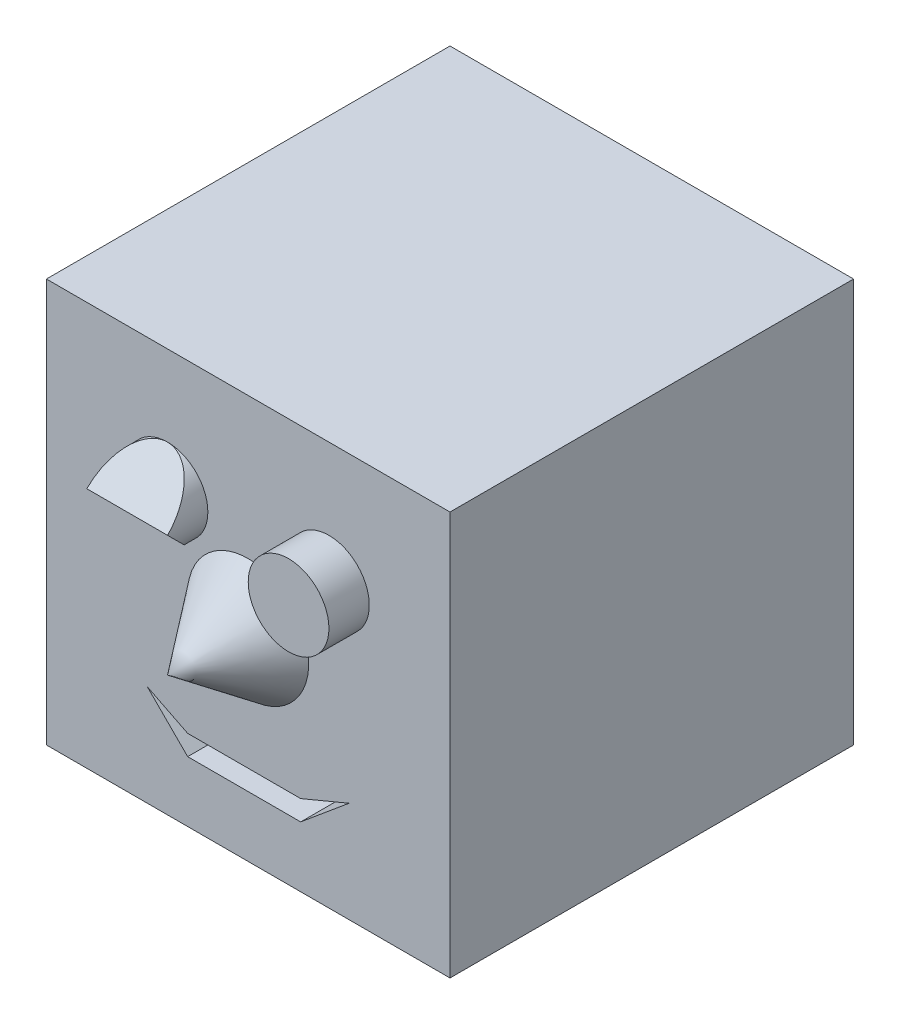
ISO-10303-21;
HEADER;
FILE_DESCRIPTION(('STEP AP214'),'2;1');
FILE_NAME('part.step','',(''),(''),'','','');
FILE_SCHEMA(('AUTOMOTIVE_DESIGN { 1 0 10303 214 1 1 1 1 }'));
ENDSEC;
DATA;
#1=APPLICATION_CONTEXT('core data for automotive mechanical design processes');
#2=APPLICATION_PROTOCOL_DEFINITION('international standard','automotive_design',2000,#1);
#3=PRODUCT_CONTEXT('',#1,'mechanical');
#4=PRODUCT('Part','Part','',(#3));
#5=PRODUCT_RELATED_PRODUCT_CATEGORY('part','',(#4));
#6=PRODUCT_DEFINITION_FORMATION('','',#4);
#7=PRODUCT_DEFINITION_CONTEXT('part definition',#1,'design');
#8=PRODUCT_DEFINITION('design','',#6,#7);
#9=PRODUCT_DEFINITION_SHAPE('','',#8);
#10=(LENGTH_UNIT() NAMED_UNIT(*) SI_UNIT(.MILLI.,.METRE.));
#11=(NAMED_UNIT(*) PLANE_ANGLE_UNIT() SI_UNIT($,.RADIAN.));
#12=(NAMED_UNIT(*) SI_UNIT($,.STERADIAN.) SOLID_ANGLE_UNIT());
#13=UNCERTAINTY_MEASURE_WITH_UNIT(LENGTH_MEASURE(1.E-05),#10,'distance_accuracy_value','');
#14=(GEOMETRIC_REPRESENTATION_CONTEXT(3) GLOBAL_UNCERTAINTY_ASSIGNED_CONTEXT((#13)) GLOBAL_UNIT_ASSIGNED_CONTEXT((#10,
#11,#12)) REPRESENTATION_CONTEXT('',''));
#15=CARTESIAN_POINT('',(0.,0.,0.));
#16=DIRECTION('',(0.,0.,1.));
#17=DIRECTION('',(1.,0.,0.));
#18=AXIS2_PLACEMENT_3D('',#15,#16,#17);
#19=CARTESIAN_POINT('',(0.,25.,0.));
#20=DIRECTION('',(0.,0.,-1.));
#21=DIRECTION('',(-1.,0.,0.));
#22=AXIS2_PLACEMENT_3D('',#19,#20,#21);
#23=PLANE('',#22);
#24=CARTESIAN_POINT('',(12.5,12.5,0.));
#25=DIRECTION('',(0.,0.,-1.));
#26=DIRECTION('',(-1.,0.,0.));
#27=AXIS2_PLACEMENT_3D('',#24,#25,#26);
#28=CIRCLE('',#27,3.75);
#29=CARTESIAN_POINT('',(8.75,12.5,0.));
#30=VERTEX_POINT('',#29);
#31=EDGE_CURVE('E129',#30,#30,#28,.T.);
#32=ORIENTED_EDGE('',*,*,#31,.T.);
#33=EDGE_LOOP('',(#32));
#34=FACE_BOUND('',#33,.T.);
#35=DIRECTION('',(1.,0.,0.));
#36=VECTOR('',#35,1.);
#37=CARTESIAN_POINT('',(15.75,3.75,0.));
#38=LINE('',#37,#36);
#39=CARTESIAN_POINT('',(8.75,3.75,0.));
#40=VERTEX_POINT('',#39);
#41=CARTESIAN_POINT('',(15.75,3.75,0.));
#42=VERTEX_POINT('',#41);
#43=EDGE_CURVE('E132',#40,#42,#38,.T.);
#44=ORIENTED_EDGE('',*,*,#43,.F.);
#45=DIRECTION('',(0.707106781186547,-0.707106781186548,0.));
#46=VECTOR('',#45,1.);
#47=CARTESIAN_POINT('',(8.75,3.75,0.));
#48=LINE('',#47,#46);
#49=CARTESIAN_POINT('',(6.25,6.25,0.));
#50=VERTEX_POINT('',#49);
#51=EDGE_CURVE('E46',#50,#40,#48,.T.);
#52=ORIENTED_EDGE('',*,*,#51,.F.);
#53=DIRECTION('',(-0.894427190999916,0.447213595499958,0.));
#54=VECTOR('',#53,1.);
#55=CARTESIAN_POINT('',(6.25,6.25,0.));
#56=LINE('',#55,#54);
#57=CARTESIAN_POINT('',(8.75,5.,0.));
#58=VERTEX_POINT('',#57);
#59=EDGE_CURVE('E146',#58,#50,#56,.T.);
#60=ORIENTED_EDGE('',*,*,#59,.F.);
#61=DIRECTION('',(-1.,0.,0.));
#62=VECTOR('',#61,1.);
#63=CARTESIAN_POINT('',(8.75,5.,0.));
#64=LINE('',#63,#62);
#65=CARTESIAN_POINT('',(15.75,5.,0.));
#66=VERTEX_POINT('',#65);
#67=EDGE_CURVE('E143',#66,#58,#64,.T.);
#68=ORIENTED_EDGE('',*,*,#67,.F.);
#69=DIRECTION('',(-0.923076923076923,-0.384615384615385,0.));
#70=VECTOR('',#69,1.);
#71=CARTESIAN_POINT('',(15.75,5.,0.));
#72=LINE('',#71,#70);
#73=CARTESIAN_POINT('',(18.75,6.25,0.));
#74=VERTEX_POINT('',#73);
#75=EDGE_CURVE('E140',#74,#66,#72,.T.);
#76=ORIENTED_EDGE('',*,*,#75,.F.);
#77=DIRECTION('',(0.768221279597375,0.64018439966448,0.));
#78=VECTOR('',#77,1.);
#79=CARTESIAN_POINT('',(18.75,6.25,0.));
#80=LINE('',#79,#78);
#81=EDGE_CURVE('E137',#42,#74,#80,.T.);
#82=ORIENTED_EDGE('',*,*,#81,.F.);
#83=EDGE_LOOP('',(#44,#52,#60,#68,#76,#82));
#84=FACE_BOUND('',#83,.T.);
#85=DIRECTION('',(0.,-1.,0.));
#86=VECTOR('',#85,1.);
#87=CARTESIAN_POINT('',(0.,0.,0.));
#88=LINE('',#87,#86);
#89=CARTESIAN_POINT('',(0.,25.,0.));
#90=VERTEX_POINT('',#89);
#91=CARTESIAN_POINT('',(0.,0.,0.));
#92=VERTEX_POINT('',#91);
#93=EDGE_CURVE('E184',#90,#92,#88,.T.);
#94=ORIENTED_EDGE('',*,*,#93,.T.);
#95=DIRECTION('',(1.,0.,0.));
#96=VECTOR('',#95,1.);
#97=CARTESIAN_POINT('',(0.,0.,0.));
#98=LINE('',#97,#96);
#99=CARTESIAN_POINT('',(25.,0.,0.));
#100=VERTEX_POINT('',#99);
#101=EDGE_CURVE('E186',#92,#100,#98,.T.);
#102=ORIENTED_EDGE('',*,*,#101,.T.);
#103=DIRECTION('',(0.,1.,0.));
#104=VECTOR('',#103,1.);
#105=CARTESIAN_POINT('',(25.,0.,0.));
#106=LINE('',#105,#104);
#107=CARTESIAN_POINT('',(25.,25.,0.));
#108=VERTEX_POINT('',#107);
#109=EDGE_CURVE('E189',#100,#108,#106,.T.);
#110=ORIENTED_EDGE('',*,*,#109,.T.);
#111=DIRECTION('',(-1.,0.,0.));
#112=VECTOR('',#111,1.);
#113=CARTESIAN_POINT('',(0.,25.,0.));
#114=LINE('',#113,#112);
#115=EDGE_CURVE('E191',#108,#90,#114,.T.);
#116=ORIENTED_EDGE('',*,*,#115,.T.);
#117=EDGE_LOOP('',(#94,#102,#110,#116));
#118=FACE_BOUND('',#117,.T.);
#119=CARTESIAN_POINT('',(7.5,17.5,0.));
#120=DIRECTION('',(0.,0.,-1.));
#121=DIRECTION('',(-1.,0.,0.));
#122=AXIS2_PLACEMENT_3D('',#119,#120,#121);
#123=CIRCLE('',#122,2.5);
#124=CARTESIAN_POINT('',(7.5,20.,0.));
#125=VERTEX_POINT('',#124);
#126=CARTESIAN_POINT('',(7.5,15.,0.));
#127=VERTEX_POINT('',#126);
#128=EDGE_CURVE('E209',#125,#127,#123,.F.);
#129=ORIENTED_EDGE('',*,*,#128,.F.);
#130=EDGE_CURVE('E217',#127,#125,#123,.F.);
#131=ORIENTED_EDGE('',*,*,#130,.F.);
#132=EDGE_LOOP('',(#129,#131));
#133=FACE_BOUND('',#132,.T.);
#134=CARTESIAN_POINT('',(17.5,17.5,0.));
#135=DIRECTION('',(0.,0.,-1.));
#136=DIRECTION('',(-1.,0.,0.));
#137=AXIS2_PLACEMENT_3D('',#134,#135,#136);
#138=CIRCLE('',#137,2.5);
#139=CARTESIAN_POINT('',(15.,17.5,0.));
#140=VERTEX_POINT('',#139);
#141=EDGE_CURVE('E11',#140,#140,#138,.F.);
#142=ORIENTED_EDGE('',*,*,#141,.F.);
#143=EDGE_LOOP('',(#142));
#144=FACE_BOUND('',#143,.T.);
#145=ADVANCED_FACE('F31',(#34,#84,#118,#133,#144),#23,.F.);
#146=CARTESIAN_POINT('',(7.5,17.5,10.));
#147=DIRECTION('',(0.,0.,-1.));
#148=DIRECTION('',(-1.,0.,0.));
#149=AXIS2_PLACEMENT_3D('',#146,#147,#148);
#150=CYLINDRICAL_SURFACE('',#149,2.5);
#151=ORIENTED_EDGE('',*,*,#130,.T.);
#152=CARTESIAN_POINT('',(7.5,17.5,2.5));
#153=DIRECTION('',(0.,-0.707106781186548,-0.707106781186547));
#154=DIRECTION('',(0.,0.707106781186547,-0.707106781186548));
#155=AXIS2_PLACEMENT_3D('',#152,#153,#154);
#156=ELLIPSE('',#155,3.53553390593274,2.5);
#157=CARTESIAN_POINT('',(10.,17.5,2.5));
#158=VERTEX_POINT('',#157);
#159=EDGE_CURVE('E39',#125,#158,#156,.T.);
#160=ORIENTED_EDGE('',*,*,#159,.T.);
#161=CARTESIAN_POINT('',(7.5,17.5,2.5));
#162=DIRECTION('',(0.,0.707106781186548,-0.707106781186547));
#163=DIRECTION('',(0.,-0.707106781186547,-0.707106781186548));
#164=AXIS2_PLACEMENT_3D('',#161,#162,#163);
#165=ELLIPSE('',#164,3.53553390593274,2.5);
#166=EDGE_CURVE('E220',#158,#127,#165,.T.);
#167=ORIENTED_EDGE('',*,*,#166,.T.);
#168=EDGE_LOOP('',(#151,#160,#167));
#169=FACE_BOUND('',#168,.T.);
#170=ADVANCED_FACE('F232',(#169),#150,.T.);
#171=CARTESIAN_POINT('',(0.,0.,-25.));
#172=DIRECTION('',(-1.,0.,0.));
#173=DIRECTION('',(0.,0.,1.));
#174=AXIS2_PLACEMENT_3D('',#171,#172,#173);
#175=PLANE('',#174);
#176=ORIENTED_EDGE('',*,*,#93,.F.);
#177=DIRECTION('',(0.,0.,1.));
#178=VECTOR('',#177,1.);
#179=CARTESIAN_POINT('',(0.,25.,-25.));
#180=LINE('',#179,#178);
#181=CARTESIAN_POINT('',(0.,25.,-25.));
#182=VERTEX_POINT('',#181);
#183=EDGE_CURVE('E207',#182,#90,#180,.T.);
#184=ORIENTED_EDGE('',*,*,#183,.F.);
#185=DIRECTION('',(0.,-1.,0.));
#186=VECTOR('',#185,1.);
#187=CARTESIAN_POINT('',(0.,0.,-25.));
#188=LINE('',#187,#186);
#189=CARTESIAN_POINT('',(0.,0.,-25.));
#190=VERTEX_POINT('',#189);
#191=EDGE_CURVE('E194',#182,#190,#188,.T.);
#192=ORIENTED_EDGE('',*,*,#191,.T.);
#193=DIRECTION('',(0.,0.,1.));
#194=VECTOR('',#193,1.);
#195=CARTESIAN_POINT('',(0.,0.,-25.));
#196=LINE('',#195,#194);
#197=EDGE_CURVE('E206',#190,#92,#196,.T.);
#198=ORIENTED_EDGE('',*,*,#197,.T.);
#199=EDGE_LOOP('',(#176,#184,#192,#198));
#200=FACE_BOUND('',#199,.T.);
#201=ADVANCED_FACE('F33',(#200),#175,.T.);
#202=CARTESIAN_POINT('',(0.,25.,-25.));
#203=DIRECTION('',(0.,1.,0.));
#204=DIRECTION('',(0.,0.,1.));
#205=AXIS2_PLACEMENT_3D('',#202,#203,#204);
#206=PLANE('',#205);
#207=ORIENTED_EDGE('',*,*,#115,.F.);
#208=DIRECTION('',(0.,0.,1.));
#209=VECTOR('',#208,1.);
#210=CARTESIAN_POINT('',(25.,25.,-25.));
#211=LINE('',#210,#209);
#212=CARTESIAN_POINT('',(25.,25.,-25.));
#213=VERTEX_POINT('',#212);
#214=EDGE_CURVE('E210',#213,#108,#211,.T.);
#215=ORIENTED_EDGE('',*,*,#214,.F.);
#216=DIRECTION('',(-1.,0.,0.));
#217=VECTOR('',#216,1.);
#218=CARTESIAN_POINT('',(0.,25.,-25.));
#219=LINE('',#218,#217);
#220=EDGE_CURVE('E203',#213,#182,#219,.T.);
#221=ORIENTED_EDGE('',*,*,#220,.T.);
#222=ORIENTED_EDGE('',*,*,#183,.T.);
#223=EDGE_LOOP('',(#207,#215,#221,#222));
#224=FACE_BOUND('',#223,.T.);
#225=ADVANCED_FACE('F258',(#224),#206,.T.);
#226=CARTESIAN_POINT('',(25.,0.,-25.));
#227=DIRECTION('',(1.,0.,0.));
#228=DIRECTION('',(0.,0.,-1.));
#229=AXIS2_PLACEMENT_3D('',#226,#227,#228);
#230=PLANE('',#229);
#231=ORIENTED_EDGE('',*,*,#109,.F.);
#232=DIRECTION('',(0.,0.,1.));
#233=VECTOR('',#232,1.);
#234=CARTESIAN_POINT('',(25.,0.,-25.));
#235=LINE('',#234,#233);
#236=CARTESIAN_POINT('',(25.,0.,-25.));
#237=VERTEX_POINT('',#236);
#238=EDGE_CURVE('E213',#237,#100,#235,.T.);
#239=ORIENTED_EDGE('',*,*,#238,.F.);
#240=DIRECTION('',(0.,1.,0.));
#241=VECTOR('',#240,1.);
#242=CARTESIAN_POINT('',(25.,0.,-25.));
#243=LINE('',#242,#241);
#244=EDGE_CURVE('E200',#237,#213,#243,.T.);
#245=ORIENTED_EDGE('',*,*,#244,.T.);
#246=ORIENTED_EDGE('',*,*,#214,.T.);
#247=EDGE_LOOP('',(#231,#239,#245,#246));
#248=FACE_BOUND('',#247,.T.);
#249=ADVANCED_FACE('F261',(#248),#230,.T.);
#250=CARTESIAN_POINT('',(0.,0.,-25.));
#251=DIRECTION('',(0.,-1.,0.));
#252=DIRECTION('',(0.,0.,-1.));
#253=AXIS2_PLACEMENT_3D('',#250,#251,#252);
#254=PLANE('',#253);
#255=ORIENTED_EDGE('',*,*,#101,.F.);
#256=ORIENTED_EDGE('',*,*,#197,.F.);
#257=DIRECTION('',(1.,0.,0.));
#258=VECTOR('',#257,1.);
#259=CARTESIAN_POINT('',(0.,0.,-25.));
#260=LINE('',#259,#258);
#261=EDGE_CURVE('E197',#190,#237,#260,.T.);
#262=ORIENTED_EDGE('',*,*,#261,.T.);
#263=ORIENTED_EDGE('',*,*,#238,.T.);
#264=EDGE_LOOP('',(#255,#256,#262,#263));
#265=FACE_BOUND('',#264,.T.);
#266=ADVANCED_FACE('F256',(#265),#254,.T.);
#267=CARTESIAN_POINT('',(0.,25.,-25.));
#268=DIRECTION('',(0.,0.,-1.));
#269=DIRECTION('',(-1.,0.,0.));
#270=AXIS2_PLACEMENT_3D('',#267,#268,#269);
#271=PLANE('',#270);
#272=ORIENTED_EDGE('',*,*,#191,.F.);
#273=ORIENTED_EDGE('',*,*,#220,.F.);
#274=ORIENTED_EDGE('',*,*,#244,.F.);
#275=ORIENTED_EDGE('',*,*,#261,.F.);
#276=EDGE_LOOP('',(#272,#273,#274,#275));
#277=FACE_BOUND('',#276,.T.);
#278=ADVANCED_FACE('F245',(#277),#271,.T.);
#279=CARTESIAN_POINT('',(5.,17.5,2.5));
#280=VERTEX_POINT('',#279);
#281=EDGE_CURVE('E54',#127,#280,#165,.T.);
#282=ORIENTED_EDGE('',*,*,#281,.T.);
#283=EDGE_CURVE('E221',#280,#125,#156,.T.);
#284=ORIENTED_EDGE('',*,*,#283,.T.);
#285=ORIENTED_EDGE('',*,*,#128,.T.);
#286=EDGE_LOOP('',(#282,#284,#285));
#287=FACE_BOUND('',#286,.T.);
#288=ADVANCED_FACE('F227',(#287),#150,.T.);
#289=CARTESIAN_POINT('',(25.,17.5,2.5));
#290=DIRECTION('',(0.,-0.707106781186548,-0.707106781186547));
#291=DIRECTION('',(0.,0.707106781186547,-0.707106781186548));
#292=AXIS2_PLACEMENT_3D('',#289,#290,#291);
#293=PLANE('',#292);
#294=ORIENTED_EDGE('',*,*,#283,.F.);
#295=DIRECTION('',(-1.,0.,0.));
#296=VECTOR('',#295,1.);
#297=CARTESIAN_POINT('',(25.,17.5,2.5));
#298=LINE('',#297,#296);
#299=EDGE_CURVE('E182',#158,#280,#298,.T.);
#300=ORIENTED_EDGE('',*,*,#299,.F.);
#301=ORIENTED_EDGE('',*,*,#159,.F.);
#302=EDGE_LOOP('',(#294,#300,#301));
#303=FACE_BOUND('',#302,.T.);
#304=ADVANCED_FACE('F236',(#303),#293,.F.);
#305=CARTESIAN_POINT('',(25.,15.,0.));
#306=DIRECTION('',(0.,0.707106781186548,-0.707106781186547));
#307=DIRECTION('',(0.,0.707106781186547,0.707106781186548));
#308=AXIS2_PLACEMENT_3D('',#305,#306,#307);
#309=PLANE('',#308);
#310=ORIENTED_EDGE('',*,*,#166,.F.);
#311=ORIENTED_EDGE('',*,*,#299,.T.);
#312=ORIENTED_EDGE('',*,*,#281,.F.);
#313=EDGE_LOOP('',(#310,#311,#312));
#314=FACE_BOUND('',#313,.T.);
#315=ADVANCED_FACE('F234',(#314),#309,.F.);
#316=CARTESIAN_POINT('',(17.5,17.5,2.5));
#317=DIRECTION('',(0.,0.,-1.));
#318=DIRECTION('',(-1.,0.,0.));
#319=AXIS2_PLACEMENT_3D('',#316,#317,#318);
#320=CYLINDRICAL_SURFACE('',#319,2.5);
#321=CARTESIAN_POINT('',(17.5,17.5,2.5));
#322=DIRECTION('',(0.,0.,1.));
#323=DIRECTION('',(1.,0.,0.));
#324=AXIS2_PLACEMENT_3D('',#321,#322,#323);
#325=CIRCLE('',#324,2.5);
#326=CARTESIAN_POINT('',(20.,17.5,2.5));
#327=VERTEX_POINT('',#326);
#328=EDGE_CURVE('E170',#327,#327,#325,.T.);
#329=ORIENTED_EDGE('',*,*,#328,.F.);
#330=EDGE_LOOP('',(#329));
#331=FACE_BOUND('',#330,.T.);
#332=ORIENTED_EDGE('',*,*,#141,.T.);
#333=EDGE_LOOP('',(#332));
#334=FACE_BOUND('',#333,.T.);
#335=ADVANCED_FACE('F243',(#331,#334),#320,.T.);
#336=CARTESIAN_POINT('',(17.5,17.5,2.5));
#337=DIRECTION('',(0.,0.,1.));
#338=DIRECTION('',(1.,0.,0.));
#339=AXIS2_PLACEMENT_3D('',#336,#337,#338);
#340=PLANE('',#339);
#341=ORIENTED_EDGE('',*,*,#328,.T.);
#342=EDGE_LOOP('',(#341));
#343=FACE_BOUND('',#342,.T.);
#344=ADVANCED_FACE('F321',(#343),#340,.T.);
#345=CARTESIAN_POINT('',(8.75,3.75,-2.5));
#346=DIRECTION('',(-0.707106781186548,-0.707106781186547,0.));
#347=DIRECTION('',(0.707106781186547,-0.707106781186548,0.));
#348=AXIS2_PLACEMENT_3D('',#345,#346,#347);
#349=PLANE('',#348);
#350=ORIENTED_EDGE('',*,*,#51,.T.);
#351=DIRECTION('',(0.,0.,1.));
#352=VECTOR('',#351,1.);
#353=CARTESIAN_POINT('',(8.75,3.75,-2.5));
#354=LINE('',#353,#352);
#355=CARTESIAN_POINT('',(8.75,3.75,-2.5));
#356=VERTEX_POINT('',#355);
#357=EDGE_CURVE('E167',#356,#40,#354,.T.);
#358=ORIENTED_EDGE('',*,*,#357,.F.);
#359=DIRECTION('',(0.707106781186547,-0.707106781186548,0.));
#360=VECTOR('',#359,1.);
#361=CARTESIAN_POINT('',(8.75,3.75,-2.5));
#362=LINE('',#361,#360);
#363=CARTESIAN_POINT('',(6.25,6.25,-2.5));
#364=VERTEX_POINT('',#363);
#365=EDGE_CURVE('E149',#364,#356,#362,.T.);
#366=ORIENTED_EDGE('',*,*,#365,.F.);
#367=DIRECTION('',(0.,0.,1.));
#368=VECTOR('',#367,1.);
#369=CARTESIAN_POINT('',(6.25,6.25,-2.5));
#370=LINE('',#369,#368);
#371=EDGE_CURVE('E168',#364,#50,#370,.T.);
#372=ORIENTED_EDGE('',*,*,#371,.T.);
#373=EDGE_LOOP('',(#350,#358,#366,#372));
#374=FACE_BOUND('',#373,.T.);
#375=ADVANCED_FACE('F331',(#374),#349,.F.);
#376=CARTESIAN_POINT('',(6.25,6.25,-2.5));
#377=DIRECTION('',(0.447213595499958,0.894427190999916,0.));
#378=DIRECTION('',(-0.894427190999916,0.447213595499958,0.));
#379=AXIS2_PLACEMENT_3D('',#376,#377,#378);
#380=PLANE('',#379);
#381=ORIENTED_EDGE('',*,*,#59,.T.);
#382=ORIENTED_EDGE('',*,*,#371,.F.);
#383=DIRECTION('',(-0.894427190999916,0.447213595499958,0.));
#384=VECTOR('',#383,1.);
#385=CARTESIAN_POINT('',(6.25,6.25,-2.5));
#386=LINE('',#385,#384);
#387=CARTESIAN_POINT('',(8.75,5.,-2.5));
#388=VERTEX_POINT('',#387);
#389=EDGE_CURVE('E164',#388,#364,#386,.T.);
#390=ORIENTED_EDGE('',*,*,#389,.F.);
#391=DIRECTION('',(0.,0.,1.));
#392=VECTOR('',#391,1.);
#393=CARTESIAN_POINT('',(8.75,5.,-2.5));
#394=LINE('',#393,#392);
#395=EDGE_CURVE('E171',#388,#58,#394,.T.);
#396=ORIENTED_EDGE('',*,*,#395,.T.);
#397=EDGE_LOOP('',(#381,#382,#390,#396));
#398=FACE_BOUND('',#397,.T.);
#399=ADVANCED_FACE('F341',(#398),#380,.F.);
#400=CARTESIAN_POINT('',(8.75,5.,-2.5));
#401=DIRECTION('',(0.,1.,0.));
#402=DIRECTION('',(0.,0.,1.));
#403=AXIS2_PLACEMENT_3D('',#400,#401,#402);
#404=PLANE('',#403);
#405=ORIENTED_EDGE('',*,*,#67,.T.);
#406=ORIENTED_EDGE('',*,*,#395,.F.);
#407=DIRECTION('',(-1.,0.,0.));
#408=VECTOR('',#407,1.);
#409=CARTESIAN_POINT('',(8.75,5.,-2.5));
#410=LINE('',#409,#408);
#411=CARTESIAN_POINT('',(15.75,5.,-2.5));
#412=VERTEX_POINT('',#411);
#413=EDGE_CURVE('E161',#412,#388,#410,.T.);
#414=ORIENTED_EDGE('',*,*,#413,.F.);
#415=DIRECTION('',(0.,0.,1.));
#416=VECTOR('',#415,1.);
#417=CARTESIAN_POINT('',(15.75,5.,-2.5));
#418=LINE('',#417,#416);
#419=EDGE_CURVE('E173',#412,#66,#418,.T.);
#420=ORIENTED_EDGE('',*,*,#419,.T.);
#421=EDGE_LOOP('',(#405,#406,#414,#420));
#422=FACE_BOUND('',#421,.T.);
#423=ADVANCED_FACE('F350',(#422),#404,.F.);
#424=CARTESIAN_POINT('',(15.75,5.,-2.5));
#425=DIRECTION('',(-0.384615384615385,0.923076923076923,0.));
#426=DIRECTION('',(-0.923076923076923,-0.384615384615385,0.));
#427=AXIS2_PLACEMENT_3D('',#424,#425,#426);
#428=PLANE('',#427);
#429=ORIENTED_EDGE('',*,*,#75,.T.);
#430=ORIENTED_EDGE('',*,*,#419,.F.);
#431=DIRECTION('',(-0.923076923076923,-0.384615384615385,0.));
#432=VECTOR('',#431,1.);
#433=CARTESIAN_POINT('',(15.75,5.,-2.5));
#434=LINE('',#433,#432);
#435=CARTESIAN_POINT('',(18.75,6.25,-2.5));
#436=VERTEX_POINT('',#435);
#437=EDGE_CURVE('E158',#436,#412,#434,.T.);
#438=ORIENTED_EDGE('',*,*,#437,.F.);
#439=DIRECTION('',(0.,0.,1.));
#440=VECTOR('',#439,1.);
#441=CARTESIAN_POINT('',(18.75,6.25,-2.5));
#442=LINE('',#441,#440);
#443=EDGE_CURVE('E175',#436,#74,#442,.T.);
#444=ORIENTED_EDGE('',*,*,#443,.T.);
#445=EDGE_LOOP('',(#429,#430,#438,#444));
#446=FACE_BOUND('',#445,.T.);
#447=ADVANCED_FACE('F360',(#446),#428,.F.);
#448=CARTESIAN_POINT('',(18.75,6.25,-2.5));
#449=DIRECTION('',(0.64018439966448,-0.768221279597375,0.));
#450=DIRECTION('',(0.768221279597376,0.64018439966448,0.));
#451=AXIS2_PLACEMENT_3D('',#448,#449,#450);
#452=PLANE('',#451);
#453=ORIENTED_EDGE('',*,*,#81,.T.);
#454=ORIENTED_EDGE('',*,*,#443,.F.);
#455=DIRECTION('',(0.768221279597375,0.64018439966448,0.));
#456=VECTOR('',#455,1.);
#457=CARTESIAN_POINT('',(18.75,6.25,-2.5));
#458=LINE('',#457,#456);
#459=CARTESIAN_POINT('',(15.75,3.75,-2.5));
#460=VERTEX_POINT('',#459);
#461=EDGE_CURVE('E155',#460,#436,#458,.T.);
#462=ORIENTED_EDGE('',*,*,#461,.F.);
#463=DIRECTION('',(0.,0.,1.));
#464=VECTOR('',#463,1.);
#465=CARTESIAN_POINT('',(15.75,3.75,-2.5));
#466=LINE('',#465,#464);
#467=EDGE_CURVE('E177',#460,#42,#466,.T.);
#468=ORIENTED_EDGE('',*,*,#467,.T.);
#469=EDGE_LOOP('',(#453,#454,#462,#468));
#470=FACE_BOUND('',#469,.T.);
#471=ADVANCED_FACE('F370',(#470),#452,.F.);
#472=CARTESIAN_POINT('',(15.75,3.75,-2.5));
#473=DIRECTION('',(0.,-1.,0.));
#474=DIRECTION('',(1.,0.,0.));
#475=AXIS2_PLACEMENT_3D('',#472,#473,#474);
#476=PLANE('',#475);
#477=ORIENTED_EDGE('',*,*,#43,.T.);
#478=ORIENTED_EDGE('',*,*,#467,.F.);
#479=DIRECTION('',(1.,0.,0.));
#480=VECTOR('',#479,1.);
#481=CARTESIAN_POINT('',(15.75,3.75,-2.5));
#482=LINE('',#481,#480);
#483=EDGE_CURVE('E152',#356,#460,#482,.T.);
#484=ORIENTED_EDGE('',*,*,#483,.F.);
#485=ORIENTED_EDGE('',*,*,#357,.T.);
#486=EDGE_LOOP('',(#477,#478,#484,#485));
#487=FACE_BOUND('',#486,.T.);
#488=ADVANCED_FACE('F380',(#487),#476,.F.);
#489=CARTESIAN_POINT('',(11.9318181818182,0.568181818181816,-2.5));
#490=DIRECTION('',(0.,0.,1.));
#491=DIRECTION('',(1.,0.,0.));
#492=AXIS2_PLACEMENT_3D('',#489,#490,#491);
#493=PLANE('',#492);
#494=ORIENTED_EDGE('',*,*,#365,.T.);
#495=ORIENTED_EDGE('',*,*,#483,.T.);
#496=ORIENTED_EDGE('',*,*,#461,.T.);
#497=ORIENTED_EDGE('',*,*,#437,.T.);
#498=ORIENTED_EDGE('',*,*,#413,.T.);
#499=ORIENTED_EDGE('',*,*,#389,.T.);
#500=EDGE_LOOP('',(#494,#495,#496,#497,#498,#499));
#501=FACE_BOUND('',#500,.T.);
#502=ADVANCED_FACE('F125',(#501),#493,.T.);
#503=CARTESIAN_POINT('',(12.5,12.5,0.));
#504=DIRECTION('',(0.,0.,-1.));
#505=DIRECTION('',(-1.,0.,0.));
#506=AXIS2_PLACEMENT_3D('',#503,#504,#505);
#507=CONICAL_SURFACE('',#506,3.75,0.643501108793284);
#508=CARTESIAN_POINT('',(12.5,12.5,5.));
#509=VERTEX_POINT('',#508);
#510=VERTEX_LOOP('',#509);
#511=FACE_BOUND('',#510,.T.);
#512=ORIENTED_EDGE('',*,*,#31,.F.);
#513=EDGE_LOOP('',(#512));
#514=FACE_BOUND('',#513,.T.);
#515=ADVANCED_FACE('F122',(#511,#514),#507,.T.);
#516=CLOSED_SHELL('',(#145,#170,#201,#225,#249,#266,#278,#288,#304,#315,#335,#344,#375,#399,
#423,#447,#471,#488,#502,#515));
#517=MANIFOLD_SOLID_BREP('B2',#516);
#518=ADVANCED_BREP_SHAPE_REPRESENTATION('',(#18,#517),#14);
#519=SHAPE_DEFINITION_REPRESENTATION(#9,#518);
ENDSEC;
END-ISO-10303-21;
